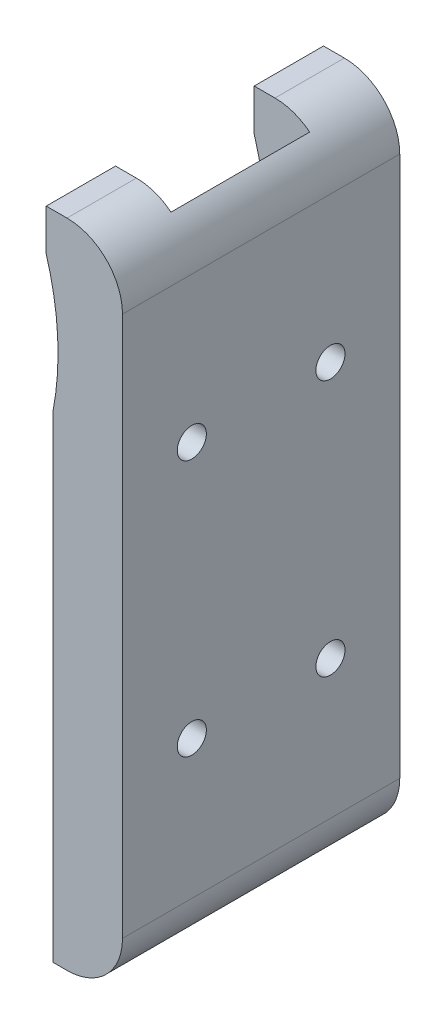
from build123d import *

# Parameters (mm, degrees)
BASE_EXTRUSION_DEPTH    = 20
ESQUISSE2_W             = 20
ESQUISSE2_H             = 94
ENL_V_MAT_EXTRU_1_DEPTH = 8
TROU_TARAUD_M5X0_81_D   = 4.2


with BuildPart() as part:
    # Esquisse1 → Base-Extrusion (new, symmetric)
    with BuildSketch(Plane.XY):
        with BuildLine():
            Line((12, 189), (9, 189))
            Line((9, 189), (9, 183))
            ThreePointArc((9, 183), (10.646129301, 173.560322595), (10, 164))
            Line((10, 164), (10, 95))
            Line((10, 95), (12, 95))
            ThreePointArc((12, 95), (17.656854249, 97.343145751), (20, 103))
            Line((20, 103), (20, 181))
            ThreePointArc((20, 181), (17.656854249, 186.656854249), (12, 189))
        make_face()
    extrude(amount=BASE_EXTRUSION_DEPTH, both=True)

    # Esquisse2 → Enl_v. mat.-Extru.1 (cut)
    with BuildSketch(Plane.ZY.offset(-9)):
        with Locations((0, 142)):
            Rectangle(ESQUISSE2_W, ESQUISSE2_H)
    extrude(amount=-ENL_V_MAT_EXTRU_1_DEPTH, mode=Mode.SUBTRACT)

    # Trou taraud_ M5x0.81 (through all)
    with Locations(Plane(origin=(20, 0, 0), x_dir=(0, 0, -1), z_dir=(1, 0, 0))):
        with Locations((-10, 123), (-10, 160), (10, 160), (10, 123)):
            Hole(TROU_TARAUD_M5X0_81_D / 2)


solid = part.part
